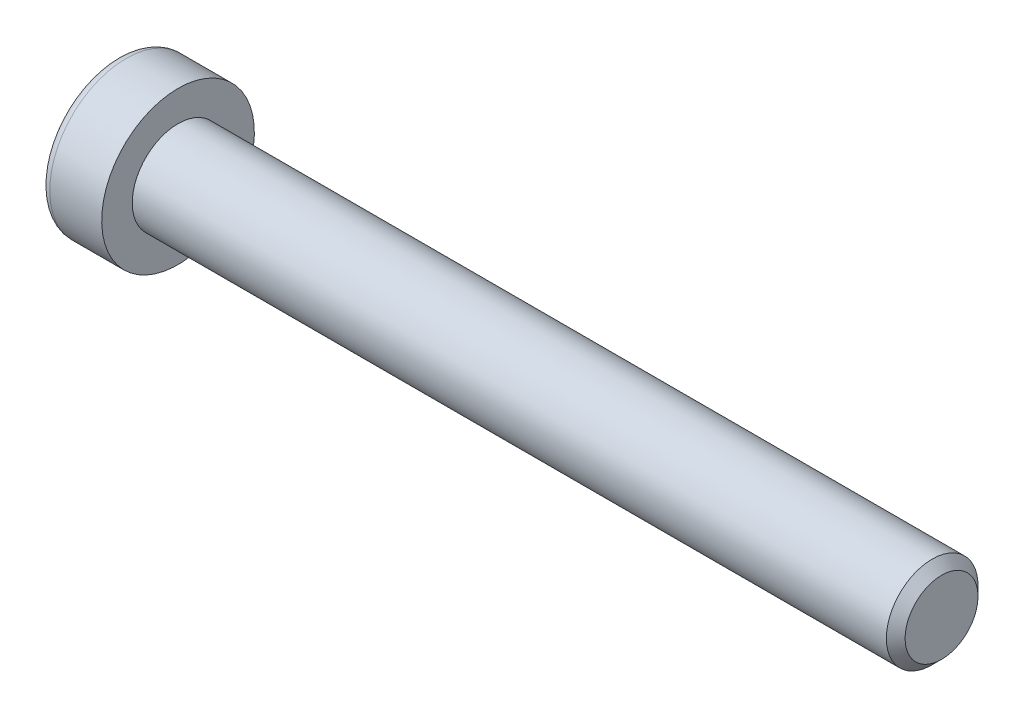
ISO-10303-21;
HEADER;
FILE_DESCRIPTION(('STEP AP214'),'2;1');
FILE_NAME('part.step','',(''),(''),'','','');
FILE_SCHEMA(('AUTOMOTIVE_DESIGN { 1 0 10303 214 1 1 1 1 }'));
ENDSEC;
DATA;
#1=APPLICATION_CONTEXT('core data for automotive mechanical design processes');
#2=APPLICATION_PROTOCOL_DEFINITION('international standard','automotive_design',2000,#1);
#3=PRODUCT_CONTEXT('',#1,'mechanical');
#4=PRODUCT('Part','Part','',(#3));
#5=PRODUCT_RELATED_PRODUCT_CATEGORY('part','',(#4));
#6=PRODUCT_DEFINITION_FORMATION('','',#4);
#7=PRODUCT_DEFINITION_CONTEXT('part definition',#1,'design');
#8=PRODUCT_DEFINITION('design','',#6,#7);
#9=PRODUCT_DEFINITION_SHAPE('','',#8);
#10=(LENGTH_UNIT() NAMED_UNIT(*) SI_UNIT(.MILLI.,.METRE.));
#11=(NAMED_UNIT(*) PLANE_ANGLE_UNIT() SI_UNIT($,.RADIAN.));
#12=(NAMED_UNIT(*) SI_UNIT($,.STERADIAN.) SOLID_ANGLE_UNIT());
#13=UNCERTAINTY_MEASURE_WITH_UNIT(LENGTH_MEASURE(1.E-05),#10,'distance_accuracy_value','');
#14=(GEOMETRIC_REPRESENTATION_CONTEXT(3) GLOBAL_UNCERTAINTY_ASSIGNED_CONTEXT((#13)) GLOBAL_UNIT_ASSIGNED_CONTEXT((#10,
#11,#12)) REPRESENTATION_CONTEXT('',''));
#15=CARTESIAN_POINT('',(0.,0.,0.));
#16=DIRECTION('',(0.,0.,1.));
#17=DIRECTION('',(1.,0.,0.));
#18=AXIS2_PLACEMENT_3D('',#15,#16,#17);
#19=CARTESIAN_POINT('',(-1.0080000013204,0.,0.));
#20=DIRECTION('',(-1.,0.,0.));
#21=DIRECTION('',(0.,0.,1.));
#22=AXIS2_PLACEMENT_3D('',#19,#20,#21);
#23=CONICAL_SURFACE('',#22,2.32325748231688,1.04719754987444);
#24=CARTESIAN_POINT('',(0.333333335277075,-1.13686837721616E-10,0.));
#25=VERTEX_POINT('',#24);
#26=VERTEX_LOOP('',#25);
#27=FACE_BOUND('',#26,.T.);
#28=CARTESIAN_POINT('',(-1.00000000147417,2.00000000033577,1.15470053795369));
#29=CARTESIAN_POINT('',(-0.970695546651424,2.00000000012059,1.05321634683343));
#30=CARTESIAN_POINT('',(-0.944044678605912,2.00000000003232,0.950856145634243));
#31=CARTESIAN_POINT('',(-0.89752638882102,1.9999999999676,0.744363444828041));
#32=CARTESIAN_POINT('',(-0.877675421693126,1.99999999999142,0.640227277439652));
#33=CARTESIAN_POINT('',(-0.846775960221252,2.00000000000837,0.433245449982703));
#34=CARTESIAN_POINT('',(-0.835521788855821,2.00000000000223,0.330431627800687));
#35=CARTESIAN_POINT('',(-0.822089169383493,1.99999999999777,0.124320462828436));
#36=CARTESIAN_POINT('',(-0.819899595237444,1.99999999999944,0.0210238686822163));
#37=CARTESIAN_POINT('',(-0.824466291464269,2.00000000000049,-0.171974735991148));
#38=CARTESIAN_POINT('',(-0.830101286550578,2.00000000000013,-0.261705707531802));
#39=CARTESIAN_POINT('',(-0.847957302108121,1.99999999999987,-0.440583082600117));
#40=CARTESIAN_POINT('',(-0.860184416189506,1.99999999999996,-0.529728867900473));
#41=CARTESIAN_POINT('',(-0.890749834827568,2.00000000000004,-0.70897474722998));
#42=CARTESIAN_POINT('',(-0.909217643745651,2.00000000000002,-0.799052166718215));
#43=CARTESIAN_POINT('',(-0.951131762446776,1.99999999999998,-0.977863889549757));
#44=CARTESIAN_POINT('',(-0.974568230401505,1.99999999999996,-1.06660048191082));
#45=CARTESIAN_POINT('',(-1.0000000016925,2.,-1.15470053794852));
#46=B_SPLINE_CURVE_WITH_KNOTS('',3,(#28,#29,#30,#31,#32,#33,#34,#35,#36,#37,#38,#39,#40,#41,#42,
#43,#44,#45),.UNSPECIFIED.,.F.,.F.,(4,2,2,2,2,2,2,2,4),(0.,0.317016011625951,0.634793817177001,
0.944707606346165,1.25424088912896,1.52370778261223,1.7934241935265,2.06912162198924,
2.3442779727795),.UNSPECIFIED.);
#47=CARTESIAN_POINT('',(-1.00000000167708,1.99999999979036,1.15470053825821));
#48=VERTEX_POINT('',#47);
#49=CARTESIAN_POINT('',(-1.00000000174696,2.,-1.15470053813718));
#50=VERTEX_POINT('',#49);
#51=EDGE_CURVE('E20',#48,#50,#46,.T.);
#52=ORIENTED_EDGE('',*,*,#51,.T.);
#53=CARTESIAN_POINT('',(-1.00000000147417,1.99999999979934,-1.15470053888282));
#54=CARTESIAN_POINT('',(-0.970695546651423,1.91211211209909,-1.2054426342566));
#55=CARTESIAN_POINT('',(-0.944044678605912,1.82346557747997,-1.25662273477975));
#56=CARTESIAN_POINT('',(-0.89752638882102,1.64463765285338,-1.3598690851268));
#57=CARTESIAN_POINT('',(-0.877675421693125,1.5544530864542,-1.41193716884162));
#58=CARTESIAN_POINT('',(-0.846775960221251,1.37520156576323,-1.51542808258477));
#59=CARTESIAN_POINT('',(-0.83552178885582,1.28616218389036,-1.56683499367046));
#60=CARTESIAN_POINT('',(-0.822089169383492,1.10766467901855,-1.66989057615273));
#61=CARTESIAN_POINT('',(-0.819899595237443,1.01820720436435,-1.72153887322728));
#62=CARTESIAN_POINT('',(-0.824466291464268,0.851065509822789,-1.81803817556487));
#63=CARTESIAN_POINT('',(-0.830101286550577,0.773356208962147,-1.86290366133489));
#64=CARTESIAN_POINT('',(-0.84795730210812,0.618443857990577,-1.95234234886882));
#65=CARTESIAN_POINT('',(-0.860184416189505,0.541241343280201,-1.99691524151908));
#66=CARTESIAN_POINT('',(-0.890749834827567,0.386009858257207,-2.0865381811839));
#67=CARTESIAN_POINT('',(-0.90921764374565,0.308000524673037,-2.131576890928));
#68=CARTESIAN_POINT('',(-0.951131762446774,0.153145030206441,-2.22098275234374));
#69=CARTESIAN_POINT('',(-0.974568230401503,0.0762968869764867,-2.26535104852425));
#70=CARTESIAN_POINT('',(-1.0000000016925,3.73024698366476E-10,-2.30940107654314));
#71=B_SPLINE_CURVE_WITH_KNOTS('',3,(#53,#54,#55,#56,#57,#58,#59,#60,#61,#62,#63,#64,#65,#66,#67,
#68,#69,#70),.UNSPECIFIED.,.F.,.F.,(4,2,2,2,2,2,2,2,4),(0.,0.317016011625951,0.634793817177,
0.944707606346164,1.25424088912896,1.52370778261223,1.7934241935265,2.06912162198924,
2.3442779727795),.UNSPECIFIED.);
#72=CARTESIAN_POINT('',(-1.00000000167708,0.,-2.30940107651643));
#73=VERTEX_POINT('',#72);
#74=EDGE_CURVE('E80',#50,#73,#71,.T.);
#75=ORIENTED_EDGE('',*,*,#74,.T.);
#76=CARTESIAN_POINT('',(-1.00000000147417,-5.36430553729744E-10,-2.30940107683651));
#77=CARTESIAN_POINT('',(-0.970695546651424,-0.0878878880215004,-2.25865898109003));
#78=CARTESIAN_POINT('',(-0.944044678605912,-0.176534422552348,-2.20747888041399));
#79=CARTESIAN_POINT('',(-0.89752638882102,-0.355362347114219,-2.10423252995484));
#80=CARTESIAN_POINT('',(-0.877675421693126,-0.445546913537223,-2.05216444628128));
#81=CARTESIAN_POINT('',(-0.846775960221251,-0.624798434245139,-1.94867353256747));
#82=CARTESIAN_POINT('',(-0.83552178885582,-0.713837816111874,-1.89726662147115));
#83=CARTESIAN_POINT('',(-0.822089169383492,-0.89233532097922,-1.79421103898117));
#84=CARTESIAN_POINT('',(-0.819899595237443,-0.981792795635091,-1.7425627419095));
#85=CARTESIAN_POINT('',(-0.824466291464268,-1.1489344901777,-1.64606343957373));
#86=CARTESIAN_POINT('',(-0.830101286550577,-1.22664379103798,-1.60119795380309));
#87=CARTESIAN_POINT('',(-0.84795730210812,-1.38155614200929,-1.51175926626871));
#88=CARTESIAN_POINT('',(-0.860184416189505,-1.45875865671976,-1.46718637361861));
#89=CARTESIAN_POINT('',(-0.890749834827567,-1.61399014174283,-1.37756343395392));
#90=CARTESIAN_POINT('',(-0.90921764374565,-1.69199947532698,-1.33252472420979));
#91=CARTESIAN_POINT('',(-0.951131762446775,-1.84685496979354,-1.24311886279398));
#92=CARTESIAN_POINT('',(-0.974568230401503,-1.92370311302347,-1.19875056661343));
#93=CARTESIAN_POINT('',(-1.0000000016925,-1.99999999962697,-1.15470053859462));
#94=B_SPLINE_CURVE_WITH_KNOTS('',3,(#76,#77,#78,#79,#80,#81,#82,#83,#84,#85,#86,#87,#88,#89,#90,
#91,#92,#93),.UNSPECIFIED.,.F.,.F.,(4,2,2,2,2,2,2,2,4),(0.,0.317016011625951,0.634793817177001,
0.944707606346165,1.25424088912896,1.52370778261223,1.7934241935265,2.06912162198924,
2.3442779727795),.UNSPECIFIED.);
#95=CARTESIAN_POINT('',(-1.00000000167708,-1.99999999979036,-1.15470053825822));
#96=VERTEX_POINT('',#95);
#97=EDGE_CURVE('E105',#73,#96,#94,.T.);
#98=ORIENTED_EDGE('',*,*,#97,.T.);
#99=CARTESIAN_POINT('',(-1.00000000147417,-2.00000000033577,-1.15470053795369));
#100=CARTESIAN_POINT('',(-0.970695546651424,-2.00000000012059,-1.05321634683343));
#101=CARTESIAN_POINT('',(-0.944044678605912,-2.00000000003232,-0.950856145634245));
#102=CARTESIAN_POINT('',(-0.89752638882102,-1.9999999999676,-0.744363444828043));
#103=CARTESIAN_POINT('',(-0.877675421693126,-1.99999999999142,-0.640227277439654));
#104=CARTESIAN_POINT('',(-0.846775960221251,-2.00000000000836,-0.433245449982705));
#105=CARTESIAN_POINT('',(-0.83552178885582,-2.00000000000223,-0.330431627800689));
#106=CARTESIAN_POINT('',(-0.822089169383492,-1.99999999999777,-0.124320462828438));
#107=CARTESIAN_POINT('',(-0.819899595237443,-1.99999999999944,-0.0210238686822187));
#108=CARTESIAN_POINT('',(-0.824466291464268,-2.00000000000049,0.171974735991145));
#109=CARTESIAN_POINT('',(-0.830101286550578,-2.00000000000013,0.261705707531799));
#110=CARTESIAN_POINT('',(-0.84795730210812,-1.99999999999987,0.440583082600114));
#111=CARTESIAN_POINT('',(-0.860184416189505,-1.99999999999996,0.529728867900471));
#112=CARTESIAN_POINT('',(-0.890749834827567,-2.00000000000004,0.708974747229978));
#113=CARTESIAN_POINT('',(-0.90921764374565,-2.00000000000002,0.799052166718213));
#114=CARTESIAN_POINT('',(-0.951131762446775,-1.99999999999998,0.977863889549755));
#115=CARTESIAN_POINT('',(-0.974568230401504,-1.99999999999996,1.06660048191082));
#116=CARTESIAN_POINT('',(-1.0000000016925,-2.,1.15470053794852));
#117=B_SPLINE_CURVE_WITH_KNOTS('',3,(#99,#100,#101,#102,#103,#104,#105,#106,#107,#108,#109,#110,
#111,#112,#113,#114,#115,#116),.UNSPECIFIED.,.F.,.F.,(4,2,2,2,2,2,2,2,4),(0.,0.317016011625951,
0.634793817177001,0.944707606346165,1.25424088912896,1.52370778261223,1.7934241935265,
2.06912162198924,2.3442779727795),.UNSPECIFIED.);
#118=CARTESIAN_POINT('',(-1.00000000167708,-1.99999999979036,1.15470053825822));
#119=VERTEX_POINT('',#118);
#120=EDGE_CURVE('E129',#96,#119,#117,.T.);
#121=ORIENTED_EDGE('',*,*,#120,.T.);
#122=CARTESIAN_POINT('',(-1.00000000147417,-1.99999999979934,1.15470053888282));
#123=CARTESIAN_POINT('',(-0.970695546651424,-1.91211211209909,1.2054426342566));
#124=CARTESIAN_POINT('',(-0.944044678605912,-1.82346557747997,1.25662273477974));
#125=CARTESIAN_POINT('',(-0.89752638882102,-1.64463765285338,1.3598690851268));
#126=CARTESIAN_POINT('',(-0.877675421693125,-1.5544530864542,1.41193716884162));
#127=CARTESIAN_POINT('',(-0.846775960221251,-1.37520156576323,1.51542808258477));
#128=CARTESIAN_POINT('',(-0.83552178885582,-1.28616218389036,1.56683499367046));
#129=CARTESIAN_POINT('',(-0.822089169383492,-1.10766467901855,1.66989057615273));
#130=CARTESIAN_POINT('',(-0.819899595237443,-1.01820720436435,1.72153887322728));
#131=CARTESIAN_POINT('',(-0.824466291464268,-0.85106550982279,1.81803817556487));
#132=CARTESIAN_POINT('',(-0.830101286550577,-0.773356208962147,1.86290366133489));
#133=CARTESIAN_POINT('',(-0.84795730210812,-0.618443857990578,1.95234234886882));
#134=CARTESIAN_POINT('',(-0.860184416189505,-0.541241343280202,1.99691524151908));
#135=CARTESIAN_POINT('',(-0.890749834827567,-0.386009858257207,2.0865381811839));
#136=CARTESIAN_POINT('',(-0.90921764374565,-0.308000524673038,2.131576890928));
#137=CARTESIAN_POINT('',(-0.951131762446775,-0.153145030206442,2.22098275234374));
#138=CARTESIAN_POINT('',(-0.974568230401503,-0.0762968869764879,2.26535104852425));
#139=CARTESIAN_POINT('',(-1.0000000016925,-3.73025682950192E-10,2.30940107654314));
#140=B_SPLINE_CURVE_WITH_KNOTS('',3,(#122,#123,#124,#125,#126,#127,#128,#129,#130,#131,#132,
#133,#134,#135,#136,#137,#138,#139),.UNSPECIFIED.,.F.,.F.,(4,2,2,2,2,2,2,2,4),(0.,
0.317016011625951,0.634793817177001,0.944707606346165,1.25424088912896,1.52370778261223,
1.7934241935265,2.06912162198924,2.3442779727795),.UNSPECIFIED.);
#141=CARTESIAN_POINT('',(-1.00000000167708,0.,2.30940107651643));
#142=VERTEX_POINT('',#141);
#143=EDGE_CURVE('E137',#119,#142,#140,.T.);
#144=ORIENTED_EDGE('',*,*,#143,.T.);
#145=CARTESIAN_POINT('',(-1.00000000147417,5.36430323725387E-10,2.30940107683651));
#146=CARTESIAN_POINT('',(-0.970695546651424,0.0878878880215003,2.25865898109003));
#147=CARTESIAN_POINT('',(-0.944044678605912,0.176534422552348,2.20747888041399));
#148=CARTESIAN_POINT('',(-0.89752638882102,0.355362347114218,2.10423252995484));
#149=CARTESIAN_POINT('',(-0.877675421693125,0.445546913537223,2.05216444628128));
#150=CARTESIAN_POINT('',(-0.846775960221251,0.624798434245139,1.94867353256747));
#151=CARTESIAN_POINT('',(-0.83552178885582,0.713837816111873,1.89726662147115));
#152=CARTESIAN_POINT('',(-0.822089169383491,0.892335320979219,1.79421103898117));
#153=CARTESIAN_POINT('',(-0.819899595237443,0.98179279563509,1.7425627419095));
#154=CARTESIAN_POINT('',(-0.824466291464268,1.1489344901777,1.64606343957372));
#155=CARTESIAN_POINT('',(-0.830101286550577,1.22664379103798,1.60119795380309));
#156=CARTESIAN_POINT('',(-0.847957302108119,1.38155614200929,1.5117592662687));
#157=CARTESIAN_POINT('',(-0.860184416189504,1.45875865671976,1.46718637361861));
#158=CARTESIAN_POINT('',(-0.890749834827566,1.61399014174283,1.37756343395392));
#159=CARTESIAN_POINT('',(-0.909217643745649,1.69199947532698,1.33252472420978));
#160=CARTESIAN_POINT('',(-0.951131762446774,1.84685496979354,1.24311886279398));
#161=CARTESIAN_POINT('',(-0.974568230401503,1.92370311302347,1.19875056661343));
#162=CARTESIAN_POINT('',(-1.0000000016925,1.99999999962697,1.15470053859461));
#163=B_SPLINE_CURVE_WITH_KNOTS('',3,(#145,#146,#147,#148,#149,#150,#151,#152,#153,#154,#155,
#156,#157,#158,#159,#160,#161,#162),.UNSPECIFIED.,.F.,.F.,(4,2,2,2,2,2,2,2,4),(0.,
0.317016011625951,0.634793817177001,0.944707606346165,1.25424088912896,1.52370778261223,
1.7934241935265,2.06912162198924,2.3442779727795),.UNSPECIFIED.);
#164=EDGE_CURVE('E82',#142,#48,#163,.T.);
#165=ORIENTED_EDGE('',*,*,#164,.T.);
#166=EDGE_LOOP('',(#52,#75,#98,#121,#144,#165));
#167=FACE_BOUND('',#166,.T.);
#168=ADVANCED_FACE('F16',(#27,#167),#23,.F.);
#169=CARTESIAN_POINT('',(-3.99999999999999,2.,1.15470053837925));
#170=DIRECTION('',(0.,1.,0.));
#171=DIRECTION('',(0.,0.,1.));
#172=AXIS2_PLACEMENT_3D('',#169,#170,#171);
#173=PLANE('',#172);
#174=DIRECTION('',(1.,0.,0.));
#175=VECTOR('',#174,1.);
#176=CARTESIAN_POINT('',(-3.99999999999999,2.,1.15470053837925));
#177=LINE('',#176,#175);
#178=CARTESIAN_POINT('',(-3.99999999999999,2.,1.15470053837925));
#179=VERTEX_POINT('',#178);
#180=EDGE_CURVE('E84',#48,#179,#177,.F.);
#181=ORIENTED_EDGE('',*,*,#180,.T.);
#182=DIRECTION('',(0.,0.,1.));
#183=VECTOR('',#182,1.);
#184=CARTESIAN_POINT('',(-3.99999999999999,2.,0.));
#185=LINE('',#184,#183);
#186=CARTESIAN_POINT('',(-3.99999999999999,2.,-1.15470053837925));
#187=VERTEX_POINT('',#186);
#188=EDGE_CURVE('E89',#187,#179,#185,.T.);
#189=ORIENTED_EDGE('',*,*,#188,.F.);
#190=DIRECTION('',(1.,0.,0.));
#191=VECTOR('',#190,1.);
#192=CARTESIAN_POINT('',(-3.99999999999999,2.,-1.15470053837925));
#193=LINE('',#192,#191);
#194=EDGE_CURVE('E87',#187,#50,#193,.T.);
#195=ORIENTED_EDGE('',*,*,#194,.T.);
#196=ORIENTED_EDGE('',*,*,#51,.F.);
#197=EDGE_LOOP('',(#181,#189,#195,#196));
#198=FACE_BOUND('',#197,.T.);
#199=ADVANCED_FACE('F76',(#198),#173,.F.);
#200=CARTESIAN_POINT('',(-3.99999999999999,0.,2.3094010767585));
#201=DIRECTION('',(0.,0.500000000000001,0.866025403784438));
#202=DIRECTION('',(0.,-0.866025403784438,0.500000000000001));
#203=AXIS2_PLACEMENT_3D('',#200,#201,#202);
#204=PLANE('',#203);
#205=DIRECTION('',(1.,0.,0.));
#206=VECTOR('',#205,1.);
#207=CARTESIAN_POINT('',(-3.99999999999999,0.,2.3094010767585));
#208=LINE('',#207,#206);
#209=CARTESIAN_POINT('',(-3.99999999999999,0.,2.3094010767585));
#210=VERTEX_POINT('',#209);
#211=EDGE_CURVE('E141',#142,#210,#208,.F.);
#212=ORIENTED_EDGE('',*,*,#211,.T.);
#213=DIRECTION('',(0.,-0.866025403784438,0.500000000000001));
#214=VECTOR('',#213,1.);
#215=CARTESIAN_POINT('',(-3.99999999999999,2.,1.15470053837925));
#216=LINE('',#215,#214);
#217=EDGE_CURVE('E95',#179,#210,#216,.T.);
#218=ORIENTED_EDGE('',*,*,#217,.F.);
#219=ORIENTED_EDGE('',*,*,#180,.F.);
#220=ORIENTED_EDGE('',*,*,#164,.F.);
#221=EDGE_LOOP('',(#212,#218,#219,#220));
#222=FACE_BOUND('',#221,.T.);
#223=ADVANCED_FACE('F145',(#222),#204,.F.);
#224=CARTESIAN_POINT('',(-3.99999999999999,-2.,1.15470053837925));
#225=DIRECTION('',(0.,-0.5,0.866025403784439));
#226=DIRECTION('',(0.,-0.866025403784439,-0.5));
#227=AXIS2_PLACEMENT_3D('',#224,#225,#226);
#228=PLANE('',#227);
#229=DIRECTION('',(1.,0.,0.));
#230=VECTOR('',#229,1.);
#231=CARTESIAN_POINT('',(-3.99999999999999,-2.,1.15470053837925));
#232=LINE('',#231,#230);
#233=CARTESIAN_POINT('',(-3.99999999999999,-2.,1.15470053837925));
#234=VERTEX_POINT('',#233);
#235=EDGE_CURVE('E136',#119,#234,#232,.F.);
#236=ORIENTED_EDGE('',*,*,#235,.T.);
#237=DIRECTION('',(0.,-0.866025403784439,-0.5));
#238=VECTOR('',#237,1.);
#239=CARTESIAN_POINT('',(-3.99999999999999,0.,2.3094010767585));
#240=LINE('',#239,#238);
#241=EDGE_CURVE('E224',#210,#234,#240,.T.);
#242=ORIENTED_EDGE('',*,*,#241,.F.);
#243=ORIENTED_EDGE('',*,*,#211,.F.);
#244=ORIENTED_EDGE('',*,*,#143,.F.);
#245=EDGE_LOOP('',(#236,#242,#243,#244));
#246=FACE_BOUND('',#245,.T.);
#247=ADVANCED_FACE('F125',(#246),#228,.F.);
#248=CARTESIAN_POINT('',(-3.99999999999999,-2.,-1.15470053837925));
#249=DIRECTION('',(0.,-1.,0.));
#250=DIRECTION('',(0.,0.,-1.));
#251=AXIS2_PLACEMENT_3D('',#248,#249,#250);
#252=PLANE('',#251);
#253=DIRECTION('',(1.,0.,0.));
#254=VECTOR('',#253,1.);
#255=CARTESIAN_POINT('',(-3.99999999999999,-2.,-1.15470053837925));
#256=LINE('',#255,#254);
#257=CARTESIAN_POINT('',(-3.99999999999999,-2.,-1.15470053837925));
#258=VERTEX_POINT('',#257);
#259=EDGE_CURVE('E135',#96,#258,#256,.F.);
#260=ORIENTED_EDGE('',*,*,#259,.T.);
#261=DIRECTION('',(0.,0.,1.));
#262=VECTOR('',#261,1.);
#263=CARTESIAN_POINT('',(-3.99999999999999,-2.,0.));
#264=LINE('',#263,#262);
#265=EDGE_CURVE('E221',#234,#258,#264,.F.);
#266=ORIENTED_EDGE('',*,*,#265,.F.);
#267=ORIENTED_EDGE('',*,*,#235,.F.);
#268=ORIENTED_EDGE('',*,*,#120,.F.);
#269=EDGE_LOOP('',(#260,#266,#267,#268));
#270=FACE_BOUND('',#269,.T.);
#271=ADVANCED_FACE('F121',(#270),#252,.F.);
#272=CARTESIAN_POINT('',(-3.99999999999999,0.,-2.3094010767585));
#273=DIRECTION('',(0.,-0.5,-0.866025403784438));
#274=DIRECTION('',(0.,0.866025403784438,-0.5));
#275=AXIS2_PLACEMENT_3D('',#272,#273,#274);
#276=PLANE('',#275);
#277=DIRECTION('',(1.,0.,0.));
#278=VECTOR('',#277,1.);
#279=CARTESIAN_POINT('',(-3.99999999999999,0.,-2.3094010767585));
#280=LINE('',#279,#278);
#281=CARTESIAN_POINT('',(-3.99999999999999,0.,-2.3094010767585));
#282=VERTEX_POINT('',#281);
#283=EDGE_CURVE('E38',#73,#282,#280,.F.);
#284=ORIENTED_EDGE('',*,*,#283,.T.);
#285=DIRECTION('',(0.,0.866025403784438,-0.5));
#286=VECTOR('',#285,1.);
#287=CARTESIAN_POINT('',(-3.99999999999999,-2.,-1.15470053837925));
#288=LINE('',#287,#286);
#289=EDGE_CURVE('E218',#258,#282,#288,.T.);
#290=ORIENTED_EDGE('',*,*,#289,.F.);
#291=ORIENTED_EDGE('',*,*,#259,.F.);
#292=ORIENTED_EDGE('',*,*,#97,.F.);
#293=EDGE_LOOP('',(#284,#290,#291,#292));
#294=FACE_BOUND('',#293,.T.);
#295=ADVANCED_FACE('F115',(#294),#276,.F.);
#296=CARTESIAN_POINT('',(-3.99999999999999,2.,-1.15470053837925));
#297=DIRECTION('',(0.,0.5,-0.866025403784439));
#298=DIRECTION('',(0.,0.866025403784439,0.5));
#299=AXIS2_PLACEMENT_3D('',#296,#297,#298);
#300=PLANE('',#299);
#301=ORIENTED_EDGE('',*,*,#194,.F.);
#302=DIRECTION('',(0.,0.866025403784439,0.5));
#303=VECTOR('',#302,1.);
#304=CARTESIAN_POINT('',(-3.99999999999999,0.,-2.3094010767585));
#305=LINE('',#304,#303);
#306=EDGE_CURVE('E216',#282,#187,#305,.T.);
#307=ORIENTED_EDGE('',*,*,#306,.F.);
#308=ORIENTED_EDGE('',*,*,#283,.F.);
#309=ORIENTED_EDGE('',*,*,#74,.F.);
#310=EDGE_LOOP('',(#301,#307,#308,#309));
#311=FACE_BOUND('',#310,.T.);
#312=ADVANCED_FACE('F93',(#311),#300,.F.);
#313=CARTESIAN_POINT('',(-3.99999999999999,3.65470053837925,0.));
#314=DIRECTION('',(-1.,0.,0.));
#315=DIRECTION('',(0.,0.,1.));
#316=AXIS2_PLACEMENT_3D('',#313,#314,#315);
#317=PLANE('',#316);
#318=ORIENTED_EDGE('',*,*,#289,.T.);
#319=ORIENTED_EDGE('',*,*,#306,.T.);
#320=ORIENTED_EDGE('',*,*,#188,.T.);
#321=ORIENTED_EDGE('',*,*,#217,.T.);
#322=ORIENTED_EDGE('',*,*,#241,.T.);
#323=ORIENTED_EDGE('',*,*,#265,.T.);
#324=EDGE_LOOP('',(#318,#319,#320,#321,#322,#323));
#325=FACE_BOUND('',#324,.T.);
#326=CARTESIAN_POINT('',(-3.99999999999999,0.,0.));
#327=DIRECTION('',(1.,0.,0.));
#328=DIRECTION('',(0.,1.,0.));
#329=AXIS2_PLACEMENT_3D('',#326,#327,#328);
#330=CIRCLE('',#329,4.4);
#331=CARTESIAN_POINT('',(-3.99999999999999,4.4,0.));
#332=VERTEX_POINT('',#331);
#333=EDGE_CURVE('E193',#332,#332,#330,.T.);
#334=ORIENTED_EDGE('',*,*,#333,.F.);
#335=EDGE_LOOP('',(#334));
#336=FACE_BOUND('',#335,.T.);
#337=ADVANCED_FACE('F114',(#325,#336),#317,.T.);
#338=CARTESIAN_POINT('',(-3.4,0.,0.));
#339=DIRECTION('',(1.,0.,0.));
#340=DIRECTION('',(0.,0.,-1.));
#341=AXIS2_PLACEMENT_3D('',#338,#339,#340);
#342=TOROIDAL_SURFACE('',#341,4.4,0.6);
#343=CARTESIAN_POINT('',(-3.4,0.,0.));
#344=DIRECTION('',(1.,0.,0.));
#345=DIRECTION('',(0.,1.,0.));
#346=AXIS2_PLACEMENT_3D('',#343,#344,#345);
#347=CIRCLE('',#346,5.);
#348=CARTESIAN_POINT('',(-3.4,5.,0.));
#349=VERTEX_POINT('',#348);
#350=EDGE_CURVE('E234',#349,#349,#347,.T.);
#351=ORIENTED_EDGE('',*,*,#350,.F.);
#352=EDGE_LOOP('',(#351));
#353=FACE_BOUND('',#352,.T.);
#354=ORIENTED_EDGE('',*,*,#333,.T.);
#355=EDGE_LOOP('',(#354));
#356=FACE_BOUND('',#355,.T.);
#357=ADVANCED_FACE('F177',(#353,#356),#342,.T.);
#358=CARTESIAN_POINT('',(-1.99999999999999,0.,0.));
#359=DIRECTION('',(1.,0.,0.));
#360=DIRECTION('',(0.,1.,0.));
#361=AXIS2_PLACEMENT_3D('',#358,#359,#360);
#362=CYLINDRICAL_SURFACE('',#361,5.);
#363=ORIENTED_EDGE('',*,*,#350,.T.);
#364=EDGE_LOOP('',(#363));
#365=FACE_BOUND('',#364,.T.);
#366=CARTESIAN_POINT('',(0.,0.,0.));
#367=DIRECTION('',(1.,0.,0.));
#368=DIRECTION('',(0.,1.,0.));
#369=AXIS2_PLACEMENT_3D('',#366,#367,#368);
#370=CIRCLE('',#369,5.);
#371=CARTESIAN_POINT('',(0.,5.,0.));
#372=VERTEX_POINT('',#371);
#373=EDGE_CURVE('E103',#372,#372,#370,.T.);
#374=ORIENTED_EDGE('',*,*,#373,.F.);
#375=EDGE_LOOP('',(#374));
#376=FACE_BOUND('',#375,.T.);
#377=ADVANCED_FACE('F174',(#365,#376),#362,.T.);
#378=CARTESIAN_POINT('',(50.,1.5,0.));
#379=DIRECTION('',(1.,0.,0.));
#380=DIRECTION('',(0.,0.,-1.));
#381=AXIS2_PLACEMENT_3D('',#378,#379,#380);
#382=PLANE('',#381);
#383=CARTESIAN_POINT('',(50.0000000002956,0.,0.));
#384=DIRECTION('',(-1.,0.,0.));
#385=DIRECTION('',(0.,0.,1.));
#386=AXIS2_PLACEMENT_3D('',#383,#384,#385);
#387=CIRCLE('',#386,2.38655000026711);
#388=CARTESIAN_POINT('',(50.0000000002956,0.,2.38655000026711));
#389=VERTEX_POINT('',#388);
#390=EDGE_CURVE('E230',#389,#389,#387,.T.);
#391=ORIENTED_EDGE('',*,*,#390,.F.);
#392=EDGE_LOOP('',(#391));
#393=FACE_BOUND('',#392,.T.);
#394=ADVANCED_FACE('F170',(#393),#382,.T.);
#395=CARTESIAN_POINT('',(0.,4.,0.));
#396=DIRECTION('',(1.,0.,0.));
#397=DIRECTION('',(0.,0.,-1.));
#398=AXIS2_PLACEMENT_3D('',#395,#396,#397);
#399=PLANE('',#398);
#400=CARTESIAN_POINT('',(0.,0.,0.));
#401=DIRECTION('',(1.,0.,0.));
#402=DIRECTION('',(0.,1.,0.));
#403=AXIS2_PLACEMENT_3D('',#400,#401,#402);
#404=CIRCLE('',#403,3.);
#405=CARTESIAN_POINT('',(0.,3.,0.));
#406=VERTEX_POINT('',#405);
#407=EDGE_CURVE('E29',#406,#406,#404,.T.);
#408=ORIENTED_EDGE('',*,*,#407,.F.);
#409=EDGE_LOOP('',(#408));
#410=FACE_BOUND('',#409,.T.);
#411=ORIENTED_EDGE('',*,*,#373,.T.);
#412=EDGE_LOOP('',(#411));
#413=FACE_BOUND('',#412,.T.);
#414=ADVANCED_FACE('F163',(#410,#413),#399,.T.);
#415=CARTESIAN_POINT('',(49.3865499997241,0.,0.));
#416=DIRECTION('',(-1.,0.,0.));
#417=DIRECTION('',(0.,0.,1.));
#418=AXIS2_PLACEMENT_3D('',#415,#416,#417);
#419=CONICAL_SURFACE('',#418,2.99999999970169,0.78539816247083);
#420=ORIENTED_EDGE('',*,*,#390,.T.);
#421=EDGE_LOOP('',(#420));
#422=FACE_BOUND('',#421,.T.);
#423=CARTESIAN_POINT('',(49.38655,0.,0.));
#424=DIRECTION('',(1.,0.,0.));
#425=DIRECTION('',(0.,1.,0.));
#426=AXIS2_PLACEMENT_3D('',#423,#424,#425);
#427=CIRCLE('',#426,3.);
#428=CARTESIAN_POINT('',(49.38655,3.,0.));
#429=VERTEX_POINT('',#428);
#430=EDGE_CURVE('E11',#429,#429,#427,.F.);
#431=ORIENTED_EDGE('',*,*,#430,.F.);
#432=EDGE_LOOP('',(#431));
#433=FACE_BOUND('',#432,.T.);
#434=ADVANCED_FACE('F156',(#422,#433),#419,.T.);
#435=CARTESIAN_POINT('',(41.,0.,0.));
#436=DIRECTION('',(1.,0.,0.));
#437=DIRECTION('',(0.,1.,0.));
#438=AXIS2_PLACEMENT_3D('',#435,#436,#437);
#439=CYLINDRICAL_SURFACE('',#438,3.);
#440=ORIENTED_EDGE('',*,*,#430,.T.);
#441=EDGE_LOOP('',(#440));
#442=FACE_BOUND('',#441,.T.);
#443=ORIENTED_EDGE('',*,*,#407,.T.);
#444=EDGE_LOOP('',(#443));
#445=FACE_BOUND('',#444,.T.);
#446=ADVANCED_FACE('F154',(#442,#445),#439,.T.);
#447=CLOSED_SHELL('',(#168,#199,#223,#247,#271,#295,#312,#337,#357,#377,#394,#414,#434,#446));
#448=MANIFOLD_SOLID_BREP('B1',#447);
#449=ADVANCED_BREP_SHAPE_REPRESENTATION('',(#18,#448),#14);
#450=SHAPE_DEFINITION_REPRESENTATION(#9,#449);
ENDSEC;
END-ISO-10303-21;
